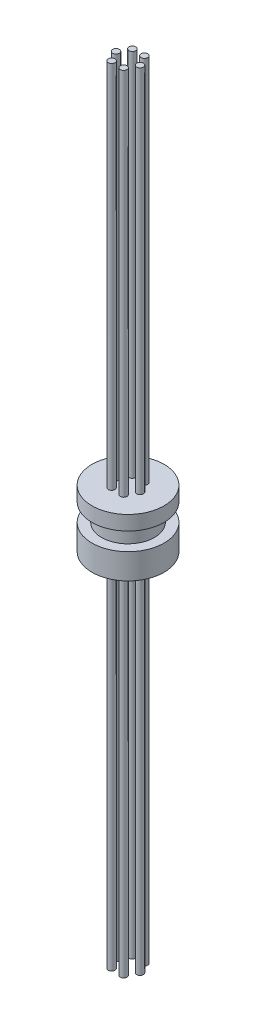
ISO-10303-21;
HEADER;
FILE_DESCRIPTION(('STEP AP214'),'2;1');
FILE_NAME('part.step','',(''),(''),'','','');
FILE_SCHEMA(('AUTOMOTIVE_DESIGN { 1 0 10303 214 1 1 1 1 }'));
ENDSEC;
DATA;
#1=APPLICATION_CONTEXT('core data for automotive mechanical design processes');
#2=APPLICATION_PROTOCOL_DEFINITION('international standard','automotive_design',2000,#1);
#3=PRODUCT_CONTEXT('',#1,'mechanical');
#4=PRODUCT('Part','Part','',(#3));
#5=PRODUCT_RELATED_PRODUCT_CATEGORY('part','',(#4));
#6=PRODUCT_DEFINITION_FORMATION('','',#4);
#7=PRODUCT_DEFINITION_CONTEXT('part definition',#1,'design');
#8=PRODUCT_DEFINITION('design','',#6,#7);
#9=PRODUCT_DEFINITION_SHAPE('','',#8);
#10=(LENGTH_UNIT() NAMED_UNIT(*) SI_UNIT(.MILLI.,.METRE.));
#11=(NAMED_UNIT(*) PLANE_ANGLE_UNIT() SI_UNIT($,.RADIAN.));
#12=(NAMED_UNIT(*) SI_UNIT($,.STERADIAN.) SOLID_ANGLE_UNIT());
#13=UNCERTAINTY_MEASURE_WITH_UNIT(LENGTH_MEASURE(1.E-05),#10,'distance_accuracy_value','');
#14=(GEOMETRIC_REPRESENTATION_CONTEXT(3) GLOBAL_UNCERTAINTY_ASSIGNED_CONTEXT((#13)) GLOBAL_UNIT_ASSIGNED_CONTEXT((#10,
#11,#12)) REPRESENTATION_CONTEXT('',''));
#15=CARTESIAN_POINT('',(0.,0.,0.));
#16=DIRECTION('',(0.,0.,1.));
#17=DIRECTION('',(1.,0.,0.));
#18=AXIS2_PLACEMENT_3D('',#15,#16,#17);
#19=CARTESIAN_POINT('',(0.,-7.62,0.));
#20=DIRECTION('',(0.,1.,0.));
#21=DIRECTION('',(0.,0.,1.));
#22=AXIS2_PLACEMENT_3D('',#19,#20,#21);
#23=PLANE('',#22);
#24=CARTESIAN_POINT('',(0.793749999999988,-7.62,1.3748153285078));
#25=DIRECTION('',(0.,1.,0.));
#26=DIRECTION('',(0.,0.,1.));
#27=AXIS2_PLACEMENT_3D('',#24,#25,#26);
#28=CIRCLE('',#27,0.444499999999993);
#29=CARTESIAN_POINT('',(0.793749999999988,-7.62,1.8193153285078));
#30=VERTEX_POINT('',#29);
#31=EDGE_CURVE('E42',#30,#30,#28,.F.);
#32=ORIENTED_EDGE('',*,*,#31,.F.);
#33=EDGE_LOOP('',(#32));
#34=FACE_BOUND('',#33,.T.);
#35=CARTESIAN_POINT('',(0.793750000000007,-7.62,-1.37481532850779));
#36=DIRECTION('',(0.,1.,0.));
#37=DIRECTION('',(0.,0.,1.));
#38=AXIS2_PLACEMENT_3D('',#35,#36,#37);
#39=CIRCLE('',#38,0.444499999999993);
#40=CARTESIAN_POINT('',(0.793750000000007,-7.62,-0.930315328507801));
#41=VERTEX_POINT('',#40);
#42=EDGE_CURVE('E57',#41,#41,#39,.F.);
#43=ORIENTED_EDGE('',*,*,#42,.F.);
#44=EDGE_LOOP('',(#43));
#45=FACE_BOUND('',#44,.T.);
#46=CARTESIAN_POINT('',(-1.5875,-7.62,0.));
#47=DIRECTION('',(0.,1.,0.));
#48=DIRECTION('',(0.,0.,1.));
#49=AXIS2_PLACEMENT_3D('',#46,#47,#48);
#50=CIRCLE('',#49,0.444499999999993);
#51=CARTESIAN_POINT('',(-1.5875,-7.62,0.444499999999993));
#52=VERTEX_POINT('',#51);
#53=EDGE_CURVE('E69',#52,#52,#50,.F.);
#54=ORIENTED_EDGE('',*,*,#53,.F.);
#55=EDGE_LOOP('',(#54));
#56=FACE_BOUND('',#55,.T.);
#57=CARTESIAN_POINT('',(0.,-7.62,0.));
#58=DIRECTION('',(0.,-1.,0.));
#59=DIRECTION('',(0.,0.,-1.));
#60=AXIS2_PLACEMENT_3D('',#57,#58,#59);
#61=CIRCLE('',#60,4.7625);
#62=CARTESIAN_POINT('',(0.,-7.62,-4.7625));
#63=VERTEX_POINT('',#62);
#64=EDGE_CURVE('E75',#63,#63,#61,.T.);
#65=ORIENTED_EDGE('',*,*,#64,.T.);
#66=EDGE_LOOP('',(#65));
#67=FACE_BOUND('',#66,.T.);
#68=CARTESIAN_POINT('',(-0.793749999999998,-7.62,-1.3748153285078));
#69=DIRECTION('',(0.,1.,0.));
#70=DIRECTION('',(0.,0.,1.));
#71=AXIS2_PLACEMENT_3D('',#68,#69,#70);
#72=CIRCLE('',#71,0.444499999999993);
#73=CARTESIAN_POINT('',(-0.793749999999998,-7.62,-0.930315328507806));
#74=VERTEX_POINT('',#73);
#75=EDGE_CURVE('E63',#74,#74,#72,.F.);
#76=ORIENTED_EDGE('',*,*,#75,.F.);
#77=EDGE_LOOP('',(#76));
#78=FACE_BOUND('',#77,.T.);
#79=CARTESIAN_POINT('',(1.5875,-7.62,0.));
#80=DIRECTION('',(0.,1.,0.));
#81=DIRECTION('',(0.,0.,1.));
#82=AXIS2_PLACEMENT_3D('',#79,#80,#81);
#83=CIRCLE('',#82,0.444499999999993);
#84=CARTESIAN_POINT('',(1.5875,-7.62,0.444499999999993));
#85=VERTEX_POINT('',#84);
#86=EDGE_CURVE('E51',#85,#85,#83,.F.);
#87=ORIENTED_EDGE('',*,*,#86,.F.);
#88=EDGE_LOOP('',(#87));
#89=FACE_BOUND('',#88,.T.);
#90=CARTESIAN_POINT('',(-0.793750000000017,-7.62,1.37481532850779));
#91=DIRECTION('',(0.,1.,0.));
#92=DIRECTION('',(0.,0.,1.));
#93=AXIS2_PLACEMENT_3D('',#90,#91,#92);
#94=CIRCLE('',#93,0.444499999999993);
#95=CARTESIAN_POINT('',(-0.793750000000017,-7.62,1.81931532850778));
#96=VERTEX_POINT('',#95);
#97=EDGE_CURVE('E10',#96,#96,#94,.F.);
#98=ORIENTED_EDGE('',*,*,#97,.F.);
#99=EDGE_LOOP('',(#98));
#100=FACE_BOUND('',#99,.T.);
#101=ADVANCED_FACE('F32',(#34,#45,#56,#67,#78,#89,#100),#23,.F.);
#102=CARTESIAN_POINT('',(0.,0.,0.));
#103=DIRECTION('',(0.,-1.,0.));
#104=DIRECTION('',(0.,0.,-1.));
#105=AXIS2_PLACEMENT_3D('',#102,#103,#104);
#106=PLANE('',#105);
#107=CARTESIAN_POINT('',(0.793749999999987,0.,1.3748153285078));
#108=DIRECTION('',(0.,-1.,0.));
#109=DIRECTION('',(0.,0.,-1.));
#110=AXIS2_PLACEMENT_3D('',#107,#108,#109);
#111=CIRCLE('',#110,0.444500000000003);
#112=CARTESIAN_POINT('',(0.793749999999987,0.,0.930315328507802));
#113=VERTEX_POINT('',#112);
#114=EDGE_CURVE('E46',#113,#113,#111,.F.);
#115=ORIENTED_EDGE('',*,*,#114,.F.);
#116=EDGE_LOOP('',(#115));
#117=FACE_BOUND('',#116,.T.);
#118=CARTESIAN_POINT('',(0.793750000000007,0.,-1.37481532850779));
#119=DIRECTION('',(0.,-1.,0.));
#120=DIRECTION('',(0.,0.,-1.));
#121=AXIS2_PLACEMENT_3D('',#118,#119,#120);
#122=CIRCLE('',#121,0.444500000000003);
#123=CARTESIAN_POINT('',(0.793750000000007,0.,-1.8193153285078));
#124=VERTEX_POINT('',#123);
#125=EDGE_CURVE('E60',#124,#124,#122,.F.);
#126=ORIENTED_EDGE('',*,*,#125,.F.);
#127=EDGE_LOOP('',(#126));
#128=FACE_BOUND('',#127,.T.);
#129=CARTESIAN_POINT('',(-1.5875,0.,0.));
#130=DIRECTION('',(0.,-1.,0.));
#131=DIRECTION('',(0.,0.,-1.));
#132=AXIS2_PLACEMENT_3D('',#129,#130,#131);
#133=CIRCLE('',#132,0.444500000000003);
#134=CARTESIAN_POINT('',(-1.5875,0.,-0.444500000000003));
#135=VERTEX_POINT('',#134);
#136=EDGE_CURVE('E72',#135,#135,#133,.F.);
#137=ORIENTED_EDGE('',*,*,#136,.F.);
#138=EDGE_LOOP('',(#137));
#139=FACE_BOUND('',#138,.T.);
#140=CARTESIAN_POINT('',(0.,0.,0.));
#141=DIRECTION('',(0.,-1.,0.));
#142=DIRECTION('',(0.,0.,-1.));
#143=AXIS2_PLACEMENT_3D('',#140,#141,#142);
#144=CIRCLE('',#143,4.7625);
#145=CARTESIAN_POINT('',(0.,0.,-4.7625));
#146=VERTEX_POINT('',#145);
#147=EDGE_CURVE('E90',#146,#146,#144,.T.);
#148=ORIENTED_EDGE('',*,*,#147,.F.);
#149=EDGE_LOOP('',(#148));
#150=FACE_BOUND('',#149,.T.);
#151=CARTESIAN_POINT('',(-0.793749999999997,0.,-1.3748153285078));
#152=DIRECTION('',(0.,-1.,0.));
#153=DIRECTION('',(0.,0.,-1.));
#154=AXIS2_PLACEMENT_3D('',#151,#152,#153);
#155=CIRCLE('',#154,0.444500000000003);
#156=CARTESIAN_POINT('',(-0.793749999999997,0.,-1.8193153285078));
#157=VERTEX_POINT('',#156);
#158=EDGE_CURVE('E66',#157,#157,#155,.F.);
#159=ORIENTED_EDGE('',*,*,#158,.F.);
#160=EDGE_LOOP('',(#159));
#161=FACE_BOUND('',#160,.T.);
#162=CARTESIAN_POINT('',(1.5875,0.,0.));
#163=DIRECTION('',(0.,-1.,0.));
#164=DIRECTION('',(0.,0.,-1.));
#165=AXIS2_PLACEMENT_3D('',#162,#163,#164);
#166=CIRCLE('',#165,0.444500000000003);
#167=CARTESIAN_POINT('',(1.5875,0.,-0.444500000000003));
#168=VERTEX_POINT('',#167);
#169=EDGE_CURVE('E54',#168,#168,#166,.F.);
#170=ORIENTED_EDGE('',*,*,#169,.F.);
#171=EDGE_LOOP('',(#170));
#172=FACE_BOUND('',#171,.T.);
#173=CARTESIAN_POINT('',(-0.793750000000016,0.,1.37481532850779));
#174=DIRECTION('',(0.,-1.,0.));
#175=DIRECTION('',(0.,0.,-1.));
#176=AXIS2_PLACEMENT_3D('',#173,#174,#175);
#177=CIRCLE('',#176,0.444500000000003);
#178=CARTESIAN_POINT('',(-0.793750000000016,0.,0.930315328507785));
#179=VERTEX_POINT('',#178);
#180=EDGE_CURVE('E38',#179,#179,#177,.F.);
#181=ORIENTED_EDGE('',*,*,#180,.F.);
#182=EDGE_LOOP('',(#181));
#183=FACE_BOUND('',#182,.T.);
#184=ADVANCED_FACE('F148',(#117,#128,#139,#150,#161,#172,#183),#106,.F.);
#185=CARTESIAN_POINT('',(0.,0.,0.));
#186=DIRECTION('',(0.,-1.,0.));
#187=DIRECTION('',(0.,0.,-1.));
#188=AXIS2_PLACEMENT_3D('',#185,#186,#187);
#189=CYLINDRICAL_SURFACE('',#188,4.7625);
#190=ORIENTED_EDGE('',*,*,#64,.F.);
#191=EDGE_LOOP('',(#190));
#192=FACE_BOUND('',#191,.T.);
#193=CARTESIAN_POINT('',(0.,-4.2672,0.));
#194=DIRECTION('',(0.,-1.,0.));
#195=DIRECTION('',(0.,0.,-1.));
#196=AXIS2_PLACEMENT_3D('',#193,#194,#195);
#197=CIRCLE('',#196,4.7625);
#198=CARTESIAN_POINT('',(0.,-4.2672,-4.7625));
#199=VERTEX_POINT('',#198);
#200=EDGE_CURVE('E78',#199,#199,#197,.T.);
#201=ORIENTED_EDGE('',*,*,#200,.T.);
#202=EDGE_LOOP('',(#201));
#203=FACE_BOUND('',#202,.T.);
#204=ADVANCED_FACE('F153',(#192,#203),#189,.T.);
#205=CARTESIAN_POINT('',(-4.7625,-4.2672,0.));
#206=DIRECTION('',(0.,-1.,0.));
#207=DIRECTION('',(0.,0.,-1.));
#208=AXIS2_PLACEMENT_3D('',#205,#206,#207);
#209=PLANE('',#208);
#210=ORIENTED_EDGE('',*,*,#200,.F.);
#211=EDGE_LOOP('',(#210));
#212=FACE_BOUND('',#211,.T.);
#213=CARTESIAN_POINT('',(0.,-4.2672,0.));
#214=DIRECTION('',(0.,-1.,0.));
#215=DIRECTION('',(0.,0.,-1.));
#216=AXIS2_PLACEMENT_3D('',#213,#214,#215);
#217=CIRCLE('',#216,3.4925);
#218=CARTESIAN_POINT('',(0.,-4.2672,-3.4925));
#219=VERTEX_POINT('',#218);
#220=EDGE_CURVE('E81',#219,#219,#217,.T.);
#221=ORIENTED_EDGE('',*,*,#220,.T.);
#222=EDGE_LOOP('',(#221));
#223=FACE_BOUND('',#222,.T.);
#224=ADVANCED_FACE('F250',(#212,#223),#209,.F.);
#225=CARTESIAN_POINT('',(0.,0.,0.));
#226=DIRECTION('',(0.,-1.,0.));
#227=DIRECTION('',(0.,0.,-1.));
#228=AXIS2_PLACEMENT_3D('',#225,#226,#227);
#229=CYLINDRICAL_SURFACE('',#228,3.4925);
#230=ORIENTED_EDGE('',*,*,#220,.F.);
#231=EDGE_LOOP('',(#230));
#232=FACE_BOUND('',#231,.T.);
#233=CARTESIAN_POINT('',(0.,-1.905,0.));
#234=DIRECTION('',(0.,-1.,0.));
#235=DIRECTION('',(0.,0.,-1.));
#236=AXIS2_PLACEMENT_3D('',#233,#234,#235);
#237=CIRCLE('',#236,3.4925);
#238=CARTESIAN_POINT('',(0.,-1.905,-3.4925));
#239=VERTEX_POINT('',#238);
#240=EDGE_CURVE('E84',#239,#239,#237,.T.);
#241=ORIENTED_EDGE('',*,*,#240,.T.);
#242=EDGE_LOOP('',(#241));
#243=FACE_BOUND('',#242,.T.);
#244=ADVANCED_FACE('F246',(#232,#243),#229,.T.);
#245=CARTESIAN_POINT('',(-4.7625,-1.905,0.));
#246=DIRECTION('',(0.,1.,0.));
#247=DIRECTION('',(0.,0.,1.));
#248=AXIS2_PLACEMENT_3D('',#245,#246,#247);
#249=PLANE('',#248);
#250=ORIENTED_EDGE('',*,*,#240,.F.);
#251=EDGE_LOOP('',(#250));
#252=FACE_BOUND('',#251,.T.);
#253=CARTESIAN_POINT('',(0.,-1.905,0.));
#254=DIRECTION('',(0.,-1.,0.));
#255=DIRECTION('',(0.,0.,-1.));
#256=AXIS2_PLACEMENT_3D('',#253,#254,#255);
#257=CIRCLE('',#256,4.7625);
#258=CARTESIAN_POINT('',(0.,-1.905,-4.7625));
#259=VERTEX_POINT('',#258);
#260=EDGE_CURVE('E87',#259,#259,#257,.T.);
#261=ORIENTED_EDGE('',*,*,#260,.T.);
#262=EDGE_LOOP('',(#261));
#263=FACE_BOUND('',#262,.T.);
#264=ADVANCED_FACE('F242',(#252,#263),#249,.F.);
#265=CARTESIAN_POINT('',(0.,0.,0.));
#266=DIRECTION('',(0.,-1.,0.));
#267=DIRECTION('',(0.,0.,-1.));
#268=AXIS2_PLACEMENT_3D('',#265,#266,#267);
#269=CYLINDRICAL_SURFACE('',#268,4.7625);
#270=ORIENTED_EDGE('',*,*,#260,.F.);
#271=EDGE_LOOP('',(#270));
#272=FACE_BOUND('',#271,.T.);
#273=ORIENTED_EDGE('',*,*,#147,.T.);
#274=EDGE_LOOP('',(#273));
#275=FACE_BOUND('',#274,.T.);
#276=ADVANCED_FACE('F237',(#272,#275),#269,.T.);
#277=CARTESIAN_POINT('',(-1.5875,48.895,0.));
#278=DIRECTION('',(0.,-1.,0.));
#279=DIRECTION('',(1.,0.,0.));
#280=AXIS2_PLACEMENT_3D('',#277,#278,#279);
#281=PLANE('',#280);
#282=CARTESIAN_POINT('',(-1.58749999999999,48.895,0.));
#283=DIRECTION('',(0.,-1.,0.));
#284=DIRECTION('',(1.,0.,0.));
#285=AXIS2_PLACEMENT_3D('',#282,#283,#284);
#286=CIRCLE('',#285,0.444500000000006);
#287=CARTESIAN_POINT('',(-1.14299999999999,48.895,0.));
#288=VERTEX_POINT('',#287);
#289=EDGE_CURVE('E96',#288,#288,#286,.T.);
#290=ORIENTED_EDGE('',*,*,#289,.F.);
#291=EDGE_LOOP('',(#290));
#292=FACE_BOUND('',#291,.T.);
#293=ADVANCED_FACE('F228',(#292),#281,.F.);
#294=CARTESIAN_POINT('',(-1.5875,0.,0.));
#295=DIRECTION('',(0.,-1.,0.));
#296=DIRECTION('',(1.,0.,0.));
#297=AXIS2_PLACEMENT_3D('',#294,#295,#296);
#298=CYLINDRICAL_SURFACE('',#297,0.444500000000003);
#299=ORIENTED_EDGE('',*,*,#289,.T.);
#300=EDGE_LOOP('',(#299));
#301=FACE_BOUND('',#300,.T.);
#302=ORIENTED_EDGE('',*,*,#136,.T.);
#303=EDGE_LOOP('',(#302));
#304=FACE_BOUND('',#303,.T.);
#305=ADVANCED_FACE('F224',(#301,#304),#298,.T.);
#306=CARTESIAN_POINT('',(-1.5875,0.,0.));
#307=DIRECTION('',(0.,-1.,0.));
#308=DIRECTION('',(1.,0.,0.));
#309=AXIS2_PLACEMENT_3D('',#306,#307,#308);
#310=CYLINDRICAL_SURFACE('',#309,0.444499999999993);
#311=CARTESIAN_POINT('',(-1.58750000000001,-55.0672,0.));
#312=DIRECTION('',(0.,-1.,0.));
#313=DIRECTION('',(1.,0.,0.));
#314=AXIS2_PLACEMENT_3D('',#311,#312,#313);
#315=CIRCLE('',#314,0.444499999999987);
#316=CARTESIAN_POINT('',(-1.14300000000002,-55.0672,0.));
#317=VERTEX_POINT('',#316);
#318=EDGE_CURVE('E93',#317,#317,#315,.T.);
#319=ORIENTED_EDGE('',*,*,#318,.F.);
#320=EDGE_LOOP('',(#319));
#321=FACE_BOUND('',#320,.T.);
#322=ORIENTED_EDGE('',*,*,#53,.T.);
#323=EDGE_LOOP('',(#322));
#324=FACE_BOUND('',#323,.T.);
#325=ADVANCED_FACE('F227',(#321,#324),#310,.T.);
#326=CARTESIAN_POINT('',(-1.58749999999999,-55.0672,0.));
#327=DIRECTION('',(0.,1.,0.));
#328=DIRECTION('',(-1.,0.,0.));
#329=AXIS2_PLACEMENT_3D('',#326,#327,#328);
#330=PLANE('',#329);
#331=ORIENTED_EDGE('',*,*,#318,.T.);
#332=EDGE_LOOP('',(#331));
#333=FACE_BOUND('',#332,.T.);
#334=ADVANCED_FACE('F222',(#333),#330,.F.);
#335=CARTESIAN_POINT('',(-0.793749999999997,48.895,-1.3748153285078));
#336=DIRECTION('',(0.,-1.,0.));
#337=DIRECTION('',(0.499999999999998,0.,0.86602540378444));
#338=AXIS2_PLACEMENT_3D('',#335,#336,#337);
#339=PLANE('',#338);
#340=CARTESIAN_POINT('',(-0.793749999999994,48.895,-1.37481532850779));
#341=DIRECTION('',(0.,-1.,0.));
#342=DIRECTION('',(0.499999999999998,0.,0.86602540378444));
#343=AXIS2_PLACEMENT_3D('',#340,#341,#342);
#344=CIRCLE('',#343,0.444500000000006);
#345=CARTESIAN_POINT('',(-0.571499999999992,48.895,-0.989867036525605));
#346=VERTEX_POINT('',#345);
#347=EDGE_CURVE('E102',#346,#346,#344,.T.);
#348=ORIENTED_EDGE('',*,*,#347,.F.);
#349=EDGE_LOOP('',(#348));
#350=FACE_BOUND('',#349,.T.);
#351=ADVANCED_FACE('F212',(#350),#339,.F.);
#352=CARTESIAN_POINT('',(-0.793749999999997,0.,-1.3748153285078));
#353=DIRECTION('',(0.,-1.,0.));
#354=DIRECTION('',(0.499999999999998,0.,0.86602540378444));
#355=AXIS2_PLACEMENT_3D('',#352,#353,#354);
#356=CYLINDRICAL_SURFACE('',#355,0.444500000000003);
#357=ORIENTED_EDGE('',*,*,#347,.T.);
#358=EDGE_LOOP('',(#357));
#359=FACE_BOUND('',#358,.T.);
#360=ORIENTED_EDGE('',*,*,#158,.T.);
#361=EDGE_LOOP('',(#360));
#362=FACE_BOUND('',#361,.T.);
#363=ADVANCED_FACE('F208',(#359,#362),#356,.T.);
#364=CARTESIAN_POINT('',(-0.793749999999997,0.,-1.3748153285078));
#365=DIRECTION('',(0.,-1.,0.));
#366=DIRECTION('',(0.499999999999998,0.,0.86602540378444));
#367=AXIS2_PLACEMENT_3D('',#364,#365,#366);
#368=CYLINDRICAL_SURFACE('',#367,0.444499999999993);
#369=CARTESIAN_POINT('',(-0.793750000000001,-55.0672,-1.3748153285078));
#370=DIRECTION('',(0.,-1.,0.));
#371=DIRECTION('',(0.499999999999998,0.,0.86602540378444));
#372=AXIS2_PLACEMENT_3D('',#369,#370,#371);
#373=CIRCLE('',#372,0.444499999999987);
#374=CARTESIAN_POINT('',(-0.571500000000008,-55.0672,-0.989867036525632));
#375=VERTEX_POINT('',#374);
#376=EDGE_CURVE('E99',#375,#375,#373,.T.);
#377=ORIENTED_EDGE('',*,*,#376,.F.);
#378=EDGE_LOOP('',(#377));
#379=FACE_BOUND('',#378,.T.);
#380=ORIENTED_EDGE('',*,*,#75,.T.);
#381=EDGE_LOOP('',(#380));
#382=FACE_BOUND('',#381,.T.);
#383=ADVANCED_FACE('F211',(#379,#382),#368,.T.);
#384=CARTESIAN_POINT('',(-0.793749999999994,-55.0672,-1.37481532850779));
#385=DIRECTION('',(0.,1.,0.));
#386=DIRECTION('',(-0.499999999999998,0.,-0.86602540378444));
#387=AXIS2_PLACEMENT_3D('',#384,#385,#386);
#388=PLANE('',#387);
#389=ORIENTED_EDGE('',*,*,#376,.T.);
#390=EDGE_LOOP('',(#389));
#391=FACE_BOUND('',#390,.T.);
#392=ADVANCED_FACE('F206',(#391),#388,.F.);
#393=CARTESIAN_POINT('',(0.793750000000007,48.895,-1.37481532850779));
#394=DIRECTION('',(0.,-1.,0.));
#395=DIRECTION('',(-0.500000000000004,0.,0.866025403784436));
#396=AXIS2_PLACEMENT_3D('',#393,#394,#395);
#397=PLANE('',#396);
#398=CARTESIAN_POINT('',(0.793750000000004,48.895,-1.37481532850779));
#399=DIRECTION('',(0.,-1.,0.));
#400=DIRECTION('',(-0.500000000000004,0.,0.866025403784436));
#401=AXIS2_PLACEMENT_3D('',#398,#399,#400);
#402=CIRCLE('',#401,0.444500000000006);
#403=CARTESIAN_POINT('',(0.571499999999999,48.895,-0.989867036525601));
#404=VERTEX_POINT('',#403);
#405=EDGE_CURVE('E108',#404,#404,#402,.T.);
#406=ORIENTED_EDGE('',*,*,#405,.F.);
#407=EDGE_LOOP('',(#406));
#408=FACE_BOUND('',#407,.T.);
#409=ADVANCED_FACE('F196',(#408),#397,.F.);
#410=CARTESIAN_POINT('',(0.793750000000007,0.,-1.37481532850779));
#411=DIRECTION('',(0.,-1.,0.));
#412=DIRECTION('',(-0.500000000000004,0.,0.866025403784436));
#413=AXIS2_PLACEMENT_3D('',#410,#411,#412);
#414=CYLINDRICAL_SURFACE('',#413,0.444500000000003);
#415=ORIENTED_EDGE('',*,*,#405,.T.);
#416=EDGE_LOOP('',(#415));
#417=FACE_BOUND('',#416,.T.);
#418=ORIENTED_EDGE('',*,*,#125,.T.);
#419=EDGE_LOOP('',(#418));
#420=FACE_BOUND('',#419,.T.);
#421=ADVANCED_FACE('F192',(#417,#420),#414,.T.);
#422=CARTESIAN_POINT('',(0.793750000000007,0.,-1.37481532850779));
#423=DIRECTION('',(0.,-1.,0.));
#424=DIRECTION('',(-0.500000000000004,0.,0.866025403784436));
#425=AXIS2_PLACEMENT_3D('',#422,#423,#424);
#426=CYLINDRICAL_SURFACE('',#425,0.444499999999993);
#427=CARTESIAN_POINT('',(0.79375000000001,-55.0672,-1.3748153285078));
#428=DIRECTION('',(0.,-1.,0.));
#429=DIRECTION('',(-0.500000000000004,0.,0.866025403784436));
#430=AXIS2_PLACEMENT_3D('',#427,#428,#429);
#431=CIRCLE('',#430,0.444499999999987);
#432=CARTESIAN_POINT('',(0.571500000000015,-55.0672,-0.989867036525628));
#433=VERTEX_POINT('',#432);
#434=EDGE_CURVE('E105',#433,#433,#431,.T.);
#435=ORIENTED_EDGE('',*,*,#434,.F.);
#436=EDGE_LOOP('',(#435));
#437=FACE_BOUND('',#436,.T.);
#438=ORIENTED_EDGE('',*,*,#42,.T.);
#439=EDGE_LOOP('',(#438));
#440=FACE_BOUND('',#439,.T.);
#441=ADVANCED_FACE('F195',(#437,#440),#426,.T.);
#442=CARTESIAN_POINT('',(0.793750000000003,-55.0672,-1.37481532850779));
#443=DIRECTION('',(0.,1.,0.));
#444=DIRECTION('',(0.500000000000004,0.,-0.866025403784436));
#445=AXIS2_PLACEMENT_3D('',#442,#443,#444);
#446=PLANE('',#445);
#447=ORIENTED_EDGE('',*,*,#434,.T.);
#448=EDGE_LOOP('',(#447));
#449=FACE_BOUND('',#448,.T.);
#450=ADVANCED_FACE('F190',(#449),#446,.F.);
#451=CARTESIAN_POINT('',(1.5875,48.895,0.));
#452=DIRECTION('',(0.,-1.,0.));
#453=DIRECTION('',(-1.,0.,0.));
#454=AXIS2_PLACEMENT_3D('',#451,#452,#453);
#455=PLANE('',#454);
#456=CARTESIAN_POINT('',(1.58749999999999,48.895,0.));
#457=DIRECTION('',(0.,-1.,0.));
#458=DIRECTION('',(-1.,0.,0.));
#459=AXIS2_PLACEMENT_3D('',#456,#457,#458);
#460=CIRCLE('',#459,0.444500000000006);
#461=CARTESIAN_POINT('',(1.14299999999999,48.895,0.));
#462=VERTEX_POINT('',#461);
#463=EDGE_CURVE('E114',#462,#462,#460,.T.);
#464=ORIENTED_EDGE('',*,*,#463,.F.);
#465=EDGE_LOOP('',(#464));
#466=FACE_BOUND('',#465,.T.);
#467=ADVANCED_FACE('F182',(#466),#455,.F.);
#468=CARTESIAN_POINT('',(1.5875,0.,0.));
#469=DIRECTION('',(0.,-1.,0.));
#470=DIRECTION('',(-1.,0.,0.));
#471=AXIS2_PLACEMENT_3D('',#468,#469,#470);
#472=CYLINDRICAL_SURFACE('',#471,0.444500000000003);
#473=ORIENTED_EDGE('',*,*,#463,.T.);
#474=EDGE_LOOP('',(#473));
#475=FACE_BOUND('',#474,.T.);
#476=ORIENTED_EDGE('',*,*,#169,.T.);
#477=EDGE_LOOP('',(#476));
#478=FACE_BOUND('',#477,.T.);
#479=ADVANCED_FACE('F172',(#475,#478),#472,.T.);
#480=CARTESIAN_POINT('',(1.5875,0.,0.));
#481=DIRECTION('',(0.,-1.,0.));
#482=DIRECTION('',(-1.,0.,0.));
#483=AXIS2_PLACEMENT_3D('',#480,#481,#482);
#484=CYLINDRICAL_SURFACE('',#483,0.444499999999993);
#485=CARTESIAN_POINT('',(1.58750000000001,-55.0672,0.));
#486=DIRECTION('',(0.,-1.,0.));
#487=DIRECTION('',(-1.,0.,0.));
#488=AXIS2_PLACEMENT_3D('',#485,#486,#487);
#489=CIRCLE('',#488,0.444499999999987);
#490=CARTESIAN_POINT('',(1.14300000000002,-55.0672,0.));
#491=VERTEX_POINT('',#490);
#492=EDGE_CURVE('E111',#491,#491,#489,.T.);
#493=ORIENTED_EDGE('',*,*,#492,.F.);
#494=EDGE_LOOP('',(#493));
#495=FACE_BOUND('',#494,.T.);
#496=ORIENTED_EDGE('',*,*,#86,.T.);
#497=EDGE_LOOP('',(#496));
#498=FACE_BOUND('',#497,.T.);
#499=ADVANCED_FACE('F169',(#495,#498),#484,.T.);
#500=CARTESIAN_POINT('',(1.58749999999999,-55.0672,0.));
#501=DIRECTION('',(0.,1.,0.));
#502=DIRECTION('',(1.,0.,0.));
#503=AXIS2_PLACEMENT_3D('',#500,#501,#502);
#504=PLANE('',#503);
#505=ORIENTED_EDGE('',*,*,#492,.T.);
#506=EDGE_LOOP('',(#505));
#507=FACE_BOUND('',#506,.T.);
#508=ADVANCED_FACE('F171',(#507),#504,.F.);
#509=CARTESIAN_POINT('',(0.793749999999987,48.895,1.3748153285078));
#510=DIRECTION('',(0.,-1.,0.));
#511=DIRECTION('',(-0.499999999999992,0.,-0.866025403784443));
#512=AXIS2_PLACEMENT_3D('',#509,#510,#511);
#513=PLANE('',#512);
#514=CARTESIAN_POINT('',(0.793749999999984,48.895,1.3748153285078));
#515=DIRECTION('',(0.,-1.,0.));
#516=DIRECTION('',(-0.499999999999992,0.,-0.866025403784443));
#517=AXIS2_PLACEMENT_3D('',#514,#515,#516);
#518=CIRCLE('',#517,0.444500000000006);
#519=CARTESIAN_POINT('',(0.571499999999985,48.895,0.989867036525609));
#520=VERTEX_POINT('',#519);
#521=EDGE_CURVE('E120',#520,#520,#518,.T.);
#522=ORIENTED_EDGE('',*,*,#521,.F.);
#523=EDGE_LOOP('',(#522));
#524=FACE_BOUND('',#523,.T.);
#525=ADVANCED_FACE('F179',(#524),#513,.F.);
#526=CARTESIAN_POINT('',(0.793749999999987,0.,1.3748153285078));
#527=DIRECTION('',(0.,-1.,0.));
#528=DIRECTION('',(-0.499999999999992,0.,-0.866025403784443));
#529=AXIS2_PLACEMENT_3D('',#526,#527,#528);
#530=CYLINDRICAL_SURFACE('',#529,0.444500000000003);
#531=ORIENTED_EDGE('',*,*,#521,.T.);
#532=EDGE_LOOP('',(#531));
#533=FACE_BOUND('',#532,.T.);
#534=ORIENTED_EDGE('',*,*,#114,.T.);
#535=EDGE_LOOP('',(#534));
#536=FACE_BOUND('',#535,.T.);
#537=ADVANCED_FACE('F360',(#533,#536),#530,.T.);
#538=CARTESIAN_POINT('',(0.793749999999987,0.,1.3748153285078));
#539=DIRECTION('',(0.,-1.,0.));
#540=DIRECTION('',(-0.499999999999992,0.,-0.866025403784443));
#541=AXIS2_PLACEMENT_3D('',#538,#539,#540);
#542=CYLINDRICAL_SURFACE('',#541,0.444499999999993);
#543=CARTESIAN_POINT('',(0.793749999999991,-55.0672,1.37481532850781));
#544=DIRECTION('',(0.,-1.,0.));
#545=DIRECTION('',(-0.499999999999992,0.,-0.866025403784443));
#546=AXIS2_PLACEMENT_3D('',#543,#544,#545);
#547=CIRCLE('',#546,0.444499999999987);
#548=CARTESIAN_POINT('',(0.571500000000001,-55.0672,0.989867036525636));
#549=VERTEX_POINT('',#548);
#550=EDGE_CURVE('E117',#549,#549,#547,.T.);
#551=ORIENTED_EDGE('',*,*,#550,.F.);
#552=EDGE_LOOP('',(#551));
#553=FACE_BOUND('',#552,.T.);
#554=ORIENTED_EDGE('',*,*,#31,.T.);
#555=EDGE_LOOP('',(#554));
#556=FACE_BOUND('',#555,.T.);
#557=ADVANCED_FACE('F142',(#553,#556),#542,.T.);
#558=CARTESIAN_POINT('',(0.793749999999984,-55.0672,1.3748153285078));
#559=DIRECTION('',(0.,1.,0.));
#560=DIRECTION('',(0.499999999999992,0.,0.866025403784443));
#561=AXIS2_PLACEMENT_3D('',#558,#559,#560);
#562=PLANE('',#561);
#563=ORIENTED_EDGE('',*,*,#550,.T.);
#564=EDGE_LOOP('',(#563));
#565=FACE_BOUND('',#564,.T.);
#566=ADVANCED_FACE('F134',(#565),#562,.F.);
#567=CARTESIAN_POINT('',(-0.793750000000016,48.895,1.37481532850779));
#568=DIRECTION('',(0.,-1.,0.));
#569=DIRECTION('',(0.50000000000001,0.,-0.866025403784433));
#570=AXIS2_PLACEMENT_3D('',#567,#568,#569);
#571=PLANE('',#570);
#572=CARTESIAN_POINT('',(-0.793750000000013,48.895,1.37481532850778));
#573=DIRECTION('',(0.,-1.,0.));
#574=DIRECTION('',(0.50000000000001,0.,-0.866025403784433));
#575=AXIS2_PLACEMENT_3D('',#572,#573,#574);
#576=CIRCLE('',#575,0.444500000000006);
#577=CARTESIAN_POINT('',(-0.571500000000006,48.895,0.989867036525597));
#578=VERTEX_POINT('',#577);
#579=EDGE_CURVE('E126',#578,#578,#576,.T.);
#580=ORIENTED_EDGE('',*,*,#579,.F.);
#581=EDGE_LOOP('',(#580));
#582=FACE_BOUND('',#581,.T.);
#583=ADVANCED_FACE('F132',(#582),#571,.F.);
#584=CARTESIAN_POINT('',(-0.793750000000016,0.,1.37481532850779));
#585=DIRECTION('',(0.,-1.,0.));
#586=DIRECTION('',(0.50000000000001,0.,-0.866025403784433));
#587=AXIS2_PLACEMENT_3D('',#584,#585,#586);
#588=CYLINDRICAL_SURFACE('',#587,0.444500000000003);
#589=ORIENTED_EDGE('',*,*,#579,.T.);
#590=EDGE_LOOP('',(#589));
#591=FACE_BOUND('',#590,.T.);
#592=ORIENTED_EDGE('',*,*,#180,.T.);
#593=EDGE_LOOP('',(#592));
#594=FACE_BOUND('',#593,.T.);
#595=ADVANCED_FACE('F130',(#591,#594),#588,.T.);
#596=CARTESIAN_POINT('',(-0.793750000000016,0.,1.37481532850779));
#597=DIRECTION('',(0.,-1.,0.));
#598=DIRECTION('',(0.50000000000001,0.,-0.866025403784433));
#599=AXIS2_PLACEMENT_3D('',#596,#597,#598);
#600=CYLINDRICAL_SURFACE('',#599,0.444499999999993);
#601=CARTESIAN_POINT('',(-0.79375000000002,-55.0672,1.37481532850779));
#602=DIRECTION('',(0.,-1.,0.));
#603=DIRECTION('',(0.50000000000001,0.,-0.866025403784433));
#604=AXIS2_PLACEMENT_3D('',#601,#602,#603);
#605=CIRCLE('',#604,0.444499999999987);
#606=CARTESIAN_POINT('',(-0.571500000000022,-55.0672,0.989867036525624));
#607=VERTEX_POINT('',#606);
#608=EDGE_CURVE('E123',#607,#607,#605,.T.);
#609=ORIENTED_EDGE('',*,*,#608,.F.);
#610=EDGE_LOOP('',(#609));
#611=FACE_BOUND('',#610,.T.);
#612=ORIENTED_EDGE('',*,*,#97,.T.);
#613=EDGE_LOOP('',(#612));
#614=FACE_BOUND('',#613,.T.);
#615=ADVANCED_FACE('F140',(#611,#614),#600,.T.);
#616=CARTESIAN_POINT('',(-0.793750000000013,-55.0672,1.37481532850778));
#617=DIRECTION('',(0.,1.,0.));
#618=DIRECTION('',(-0.50000000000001,0.,0.866025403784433));
#619=AXIS2_PLACEMENT_3D('',#616,#617,#618);
#620=PLANE('',#619);
#621=ORIENTED_EDGE('',*,*,#608,.T.);
#622=EDGE_LOOP('',(#621));
#623=FACE_BOUND('',#622,.T.);
#624=ADVANCED_FACE('F423',(#623),#620,.F.);
#625=CLOSED_SHELL('',(#101,#184,#204,#224,#244,#264,#276,#293,#305,#325,#334,#351,#363,#383,
#392,#409,#421,#441,#450,#467,#479,#499,#508,#525,#537,#557,#566,#583,#595,#615,#624));
#626=MANIFOLD_SOLID_BREP('B2',#625);
#627=ADVANCED_BREP_SHAPE_REPRESENTATION('',(#18,#626),#14);
#628=SHAPE_DEFINITION_REPRESENTATION(#9,#627);
ENDSEC;
END-ISO-10303-21;
